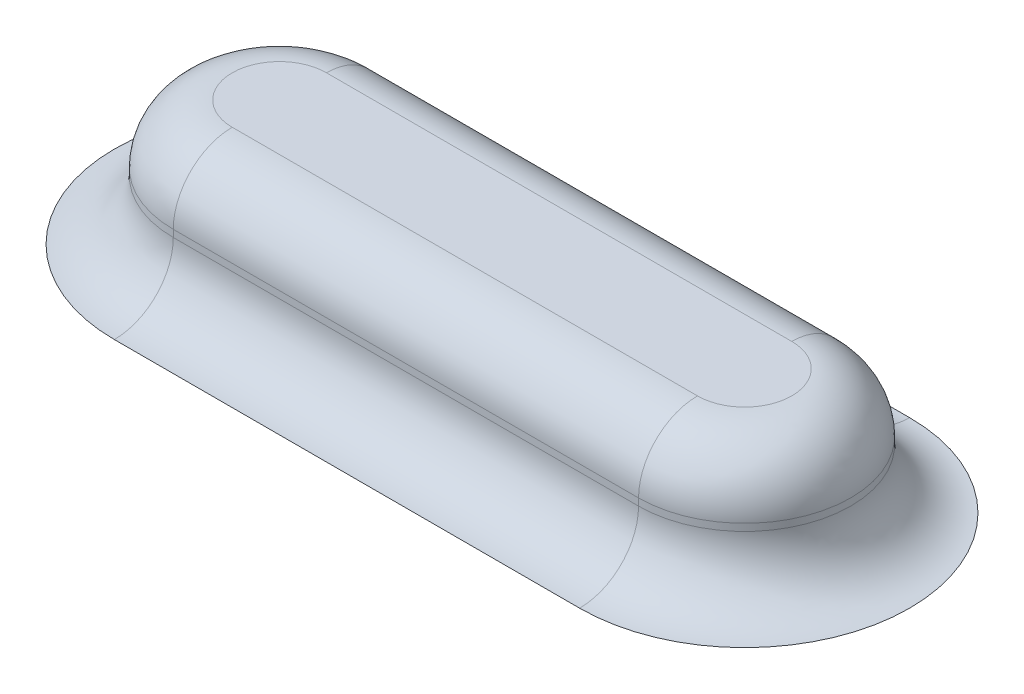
from build123d import *

# Parameters (mm, degrees)
SKETCH1_W          = 230.64362851
SKETCH1_H          = 144.792944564
EXTRUDE1_DEPTH     = 26.924
EXTRUDE2_DEPTH     = 26.924
FILLET1_R          = 12.7
SKETCH3_W          = 230.64362851
SKETCH3_H          = 144.792944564
CUT_EXTRUDE1_DEPTH = 26.924


with BuildPart() as part:
    # Sketch1 → Extrude1 (new body)
    with BuildSketch(Plane(origin=(0, 0, 0), x_dir=(1, 0, 0), z_dir=(0, 1, 0))):
        with Locations((1.281353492, 12.813534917)):
            Rectangle(SKETCH1_W, SKETCH1_H)
    extrude(amount=EXTRUDE1_DEPTH)

    # Sketch2 → Extrude2 (add)
    with BuildSketch(Plane(origin=(0, 26.924, 0), x_dir=(1, 0, 0), z_dir=(0, 1, 0))):
        with BuildLine():
            Line((-63.80585477, 1.078681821), (36.461202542, 1.078681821))
            ThreePointArc((36.461202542, 1.078681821), (59.321202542, 23.938681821), (36.461202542, 46.798681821))
            Line((36.461202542, 46.798681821), (-63.80585477, 46.798681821))
            ThreePointArc((-63.80585477, 46.798681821), (-86.66585477, 23.938681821), (-63.80585477, 1.078681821))
        make_face()
    extrude(amount=EXTRUDE2_DEPTH)

    # Fillet1
    fillet1_edges = [part.edges().sort_by_distance(p)[0] for p in [
        (-86.66585477, 26.924, -23.938681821),
        (-13.672326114, 26.924, -1.078681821),
        (59.321202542, 26.924, -23.938681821),
        (-13.672326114, 26.924, -46.798681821),
        (-86.66585477, 53.848, -23.938681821),
        (-13.672326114, 53.848, -1.078681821),
        (59.321202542, 53.848, -23.938681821),
        (-13.672326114, 53.848, -46.798681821),
    ]]
    fillet(fillet1_edges, radius=FILLET1_R)

    # Sketch3 → Cut-Extrude1 (cut)
    with BuildSketch(Plane(origin=(0, 26.924, 0), x_dir=(1, 0, 0), z_dir=(0, 1, 0))):
        with Locations((1.281353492, 12.813534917)):
            Rectangle(SKETCH3_W, SKETCH3_H)
    extrude(amount=-CUT_EXTRUDE1_DEPTH, mode=Mode.SUBTRACT)


solid = part.part
